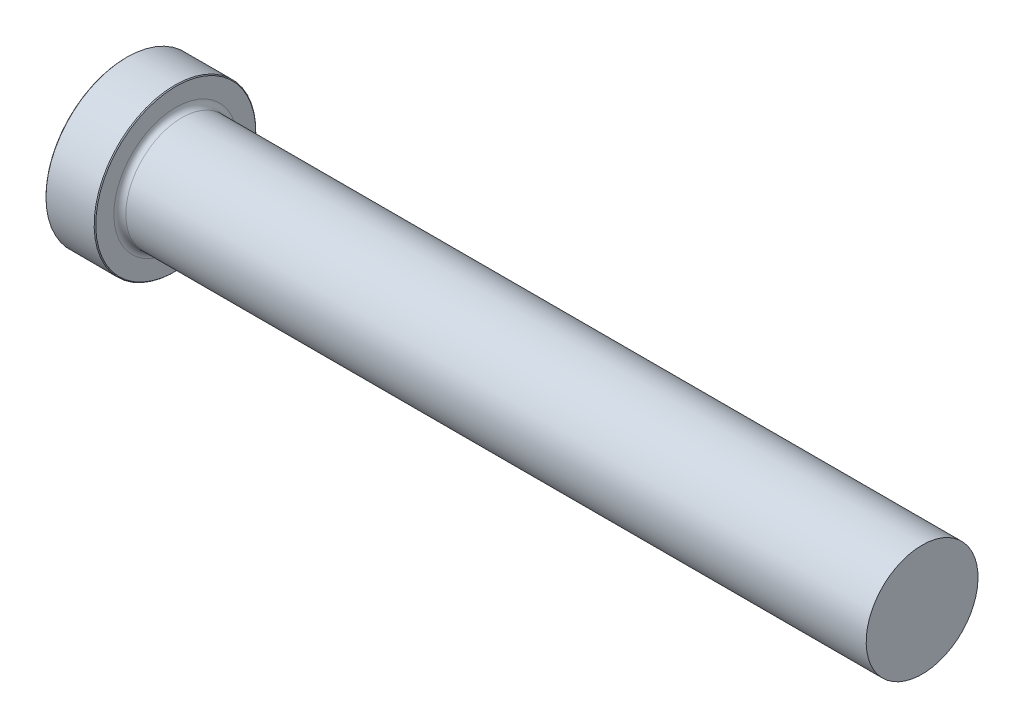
ISO-10303-21;
HEADER;
FILE_DESCRIPTION(('STEP AP214'),'2;1');
FILE_NAME('part.step','',(''),(''),'','','');
FILE_SCHEMA(('AUTOMOTIVE_DESIGN { 1 0 10303 214 1 1 1 1 }'));
ENDSEC;
DATA;
#1=APPLICATION_CONTEXT('core data for automotive mechanical design processes');
#2=APPLICATION_PROTOCOL_DEFINITION('international standard','automotive_design',2000,#1);
#3=PRODUCT_CONTEXT('',#1,'mechanical');
#4=PRODUCT('Part','Part','',(#3));
#5=PRODUCT_RELATED_PRODUCT_CATEGORY('part','',(#4));
#6=PRODUCT_DEFINITION_FORMATION('','',#4);
#7=PRODUCT_DEFINITION_CONTEXT('part definition',#1,'design');
#8=PRODUCT_DEFINITION('design','',#6,#7);
#9=PRODUCT_DEFINITION_SHAPE('','',#8);
#10=(LENGTH_UNIT() NAMED_UNIT(*) SI_UNIT(.MILLI.,.METRE.));
#11=(NAMED_UNIT(*) PLANE_ANGLE_UNIT() SI_UNIT($,.RADIAN.));
#12=(NAMED_UNIT(*) SI_UNIT($,.STERADIAN.) SOLID_ANGLE_UNIT());
#13=UNCERTAINTY_MEASURE_WITH_UNIT(LENGTH_MEASURE(1.E-05),#10,'distance_accuracy_value','');
#14=(GEOMETRIC_REPRESENTATION_CONTEXT(3) GLOBAL_UNCERTAINTY_ASSIGNED_CONTEXT((#13)) GLOBAL_UNIT_ASSIGNED_CONTEXT((#10,
#11,#12)) REPRESENTATION_CONTEXT('',''));
#15=CARTESIAN_POINT('',(0.,0.,0.));
#16=DIRECTION('',(0.,0.,1.));
#17=DIRECTION('',(1.,0.,0.));
#18=AXIS2_PLACEMENT_3D('',#15,#16,#17);
#19=CARTESIAN_POINT('',(101.6,7.13739999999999,0.));
#20=DIRECTION('',(1.,0.,0.));
#21=DIRECTION('',(0.,1.,0.));
#22=AXIS2_PLACEMENT_3D('',#19,#20,#21);
#23=PLANE('',#22);
#24=CARTESIAN_POINT('',(101.6,0.,0.));
#25=DIRECTION('',(1.,0.,0.));
#26=DIRECTION('',(0.,1.,0.));
#27=AXIS2_PLACEMENT_3D('',#24,#25,#26);
#28=CIRCLE('',#27,7.1374);
#29=CARTESIAN_POINT('',(101.6,7.13739999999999,0.));
#30=VERTEX_POINT('',#29);
#31=EDGE_CURVE('E50',#30,#30,#28,.T.);
#32=ORIENTED_EDGE('',*,*,#31,.T.);
#33=EDGE_LOOP('',(#32));
#34=FACE_BOUND('',#33,.T.);
#35=ADVANCED_FACE('F30',(#34),#23,.T.);
#36=CARTESIAN_POINT('',(101.6,0.,0.));
#37=DIRECTION('',(1.,0.,0.));
#38=DIRECTION('',(0.,1.,0.));
#39=AXIS2_PLACEMENT_3D('',#36,#37,#38);
#40=CYLINDRICAL_SURFACE('',#39,7.1374);
#41=CARTESIAN_POINT('',(7.11199999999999,0.,0.));
#42=DIRECTION('',(1.,0.,0.));
#43=DIRECTION('',(0.,1.,0.));
#44=AXIS2_PLACEMENT_3D('',#41,#42,#43);
#45=CIRCLE('',#44,7.13739999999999);
#46=CARTESIAN_POINT('',(7.11199999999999,7.13739999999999,0.));
#47=VERTEX_POINT('',#46);
#48=EDGE_CURVE('E53',#47,#47,#45,.T.);
#49=ORIENTED_EDGE('',*,*,#48,.T.);
#50=EDGE_LOOP('',(#49));
#51=FACE_BOUND('',#50,.T.);
#52=ORIENTED_EDGE('',*,*,#31,.F.);
#53=EDGE_LOOP('',(#52));
#54=FACE_BOUND('',#53,.T.);
#55=ADVANCED_FACE('F74',(#51,#54),#40,.T.);
#56=CARTESIAN_POINT('',(7.112,0.,0.));
#57=DIRECTION('',(1.,0.,0.));
#58=DIRECTION('',(0.,1.,0.));
#59=AXIS2_PLACEMENT_3D('',#56,#57,#58);
#60=TOROIDAL_SURFACE('',#59,7.8994,0.762);
#61=CARTESIAN_POINT('',(6.34999999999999,0.,0.));
#62=DIRECTION('',(1.,0.,0.));
#63=DIRECTION('',(0.,1.,0.));
#64=AXIS2_PLACEMENT_3D('',#61,#62,#63);
#65=CIRCLE('',#64,7.8994);
#66=CARTESIAN_POINT('',(6.35,7.8994,0.));
#67=VERTEX_POINT('',#66);
#68=EDGE_CURVE('E56',#67,#67,#65,.T.);
#69=ORIENTED_EDGE('',*,*,#68,.T.);
#70=EDGE_LOOP('',(#69));
#71=FACE_BOUND('',#70,.T.);
#72=ORIENTED_EDGE('',*,*,#48,.F.);
#73=EDGE_LOOP('',(#72));
#74=FACE_BOUND('',#73,.T.);
#75=ADVANCED_FACE('F60',(#71,#74),#60,.F.);
#76=CARTESIAN_POINT('',(6.35,10.31875,0.));
#77=DIRECTION('',(1.,0.,0.));
#78=DIRECTION('',(0.,1.,0.));
#79=AXIS2_PLACEMENT_3D('',#76,#77,#78);
#80=PLANE('',#79);
#81=CARTESIAN_POINT('',(6.35,0.,0.));
#82=DIRECTION('',(1.,0.,0.));
#83=DIRECTION('',(0.,1.,0.));
#84=AXIS2_PLACEMENT_3D('',#81,#82,#83);
#85=CIRCLE('',#84,10.21715);
#86=CARTESIAN_POINT('',(6.35,10.21715,0.));
#87=VERTEX_POINT('',#86);
#88=EDGE_CURVE('E10',#87,#87,#85,.T.);
#89=ORIENTED_EDGE('',*,*,#88,.T.);
#90=EDGE_LOOP('',(#89));
#91=FACE_BOUND('',#90,.T.);
#92=ORIENTED_EDGE('',*,*,#68,.F.);
#93=EDGE_LOOP('',(#92));
#94=FACE_BOUND('',#93,.T.);
#95=ADVANCED_FACE('F63',(#91,#94),#80,.T.);
#96=CARTESIAN_POINT('',(101.6,0.,0.));
#97=DIRECTION('',(1.,0.,0.));
#98=DIRECTION('',(0.,1.,0.));
#99=AXIS2_PLACEMENT_3D('',#96,#97,#98);
#100=CYLINDRICAL_SURFACE('',#99,10.31875);
#101=CARTESIAN_POINT('',(0.101599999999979,0.,0.));
#102=DIRECTION('',(-1.,0.,0.));
#103=DIRECTION('',(0.,-1.,0.));
#104=AXIS2_PLACEMENT_3D('',#101,#102,#103);
#105=CIRCLE('',#104,10.31875);
#106=CARTESIAN_POINT('',(0.101599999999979,-10.31875,0.));
#107=VERTEX_POINT('',#106);
#108=EDGE_CURVE('E41',#107,#107,#105,.F.);
#109=ORIENTED_EDGE('',*,*,#108,.T.);
#110=EDGE_LOOP('',(#109));
#111=FACE_BOUND('',#110,.T.);
#112=CARTESIAN_POINT('',(6.24840000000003,0.,0.));
#113=DIRECTION('',(1.,0.,0.));
#114=DIRECTION('',(0.,1.,0.));
#115=AXIS2_PLACEMENT_3D('',#112,#113,#114);
#116=CIRCLE('',#115,10.31875);
#117=CARTESIAN_POINT('',(6.24840000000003,10.31875,0.));
#118=VERTEX_POINT('',#117);
#119=EDGE_CURVE('E45',#118,#118,#116,.F.);
#120=ORIENTED_EDGE('',*,*,#119,.T.);
#121=EDGE_LOOP('',(#120));
#122=FACE_BOUND('',#121,.T.);
#123=ADVANCED_FACE('F65',(#111,#122),#100,.T.);
#124=CARTESIAN_POINT('',(0.,0.,0.));
#125=DIRECTION('',(-1.,0.,0.));
#126=DIRECTION('',(0.,-1.,0.));
#127=AXIS2_PLACEMENT_3D('',#124,#125,#126);
#128=PLANE('',#127);
#129=CARTESIAN_POINT('',(0.,0.,0.));
#130=DIRECTION('',(-1.,0.,0.));
#131=DIRECTION('',(0.,-1.,0.));
#132=AXIS2_PLACEMENT_3D('',#129,#130,#131);
#133=CIRCLE('',#132,10.21715);
#134=CARTESIAN_POINT('',(0.,-10.21715,0.));
#135=VERTEX_POINT('',#134);
#136=EDGE_CURVE('E37',#135,#135,#133,.T.);
#137=ORIENTED_EDGE('',*,*,#136,.T.);
#138=EDGE_LOOP('',(#137));
#139=FACE_BOUND('',#138,.T.);
#140=ADVANCED_FACE('F71',(#139),#128,.T.);
#141=CARTESIAN_POINT('',(0.101599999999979,0.,0.));
#142=DIRECTION('',(1.,0.,0.));
#143=DIRECTION('',(0.,1.,0.));
#144=AXIS2_PLACEMENT_3D('',#141,#142,#143);
#145=CONICAL_SURFACE('',#144,10.31875,0.78539816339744);
#146=ORIENTED_EDGE('',*,*,#136,.F.);
#147=EDGE_LOOP('',(#146));
#148=FACE_BOUND('',#147,.T.);
#149=ORIENTED_EDGE('',*,*,#108,.F.);
#150=EDGE_LOOP('',(#149));
#151=FACE_BOUND('',#150,.T.);
#152=ADVANCED_FACE('F84',(#148,#151),#145,.T.);
#153=CARTESIAN_POINT('',(6.34999999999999,0.,0.));
#154=DIRECTION('',(-1.,0.,0.));
#155=DIRECTION('',(0.,-1.,0.));
#156=AXIS2_PLACEMENT_3D('',#153,#154,#155);
#157=CONICAL_SURFACE('',#156,10.21715,0.785398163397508);
#158=ORIENTED_EDGE('',*,*,#119,.F.);
#159=EDGE_LOOP('',(#158));
#160=FACE_BOUND('',#159,.T.);
#161=ORIENTED_EDGE('',*,*,#88,.F.);
#162=EDGE_LOOP('',(#161));
#163=FACE_BOUND('',#162,.T.);
#164=ADVANCED_FACE('F32',(#160,#163),#157,.T.);
#165=CLOSED_SHELL('',(#35,#55,#75,#95,#123,#140,#152,#164));
#166=MANIFOLD_SOLID_BREP('B2',#165);
#167=ADVANCED_BREP_SHAPE_REPRESENTATION('',(#18,#166),#14);
#168=SHAPE_DEFINITION_REPRESENTATION(#9,#167);
ENDSEC;
END-ISO-10303-21;
